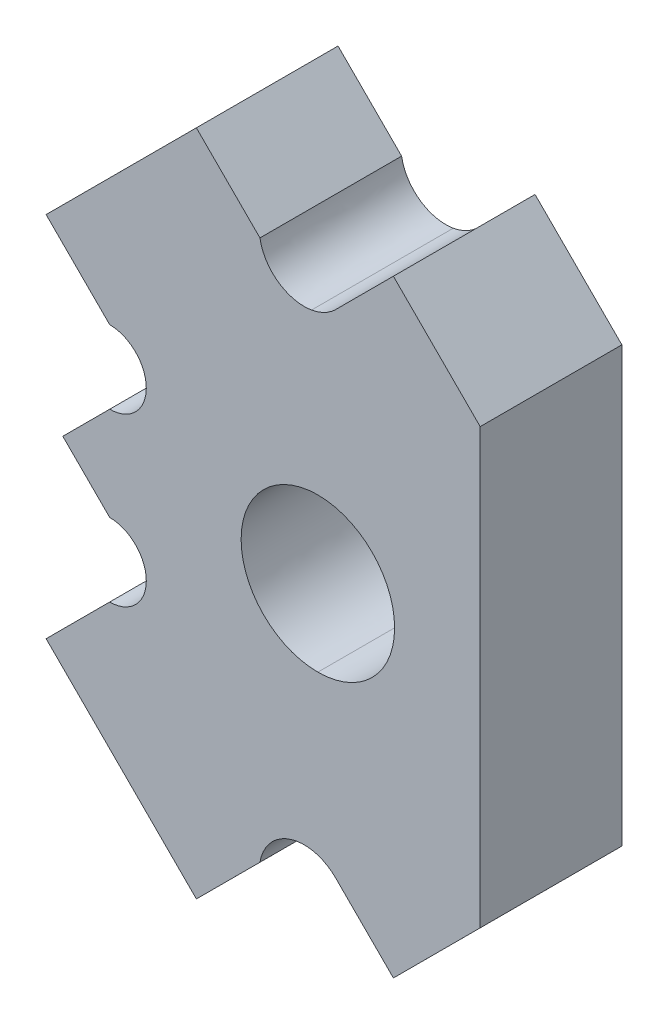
ISO-10303-21;
HEADER;
FILE_DESCRIPTION(('STEP AP214'),'2;1');
FILE_NAME('part.step','',(''),(''),'','','');
FILE_SCHEMA(('AUTOMOTIVE_DESIGN { 1 0 10303 214 1 1 1 1 }'));
ENDSEC;
DATA;
#1=APPLICATION_CONTEXT('core data for automotive mechanical design processes');
#2=APPLICATION_PROTOCOL_DEFINITION('international standard','automotive_design',2000,#1);
#3=PRODUCT_CONTEXT('',#1,'mechanical');
#4=PRODUCT('Part','Part','',(#3));
#5=PRODUCT_RELATED_PRODUCT_CATEGORY('part','',(#4));
#6=PRODUCT_DEFINITION_FORMATION('','',#4);
#7=PRODUCT_DEFINITION_CONTEXT('part definition',#1,'design');
#8=PRODUCT_DEFINITION('design','',#6,#7);
#9=PRODUCT_DEFINITION_SHAPE('','',#8);
#10=(LENGTH_UNIT() NAMED_UNIT(*) SI_UNIT(.MILLI.,.METRE.));
#11=(NAMED_UNIT(*) PLANE_ANGLE_UNIT() SI_UNIT($,.RADIAN.));
#12=(NAMED_UNIT(*) SI_UNIT($,.STERADIAN.) SOLID_ANGLE_UNIT());
#13=UNCERTAINTY_MEASURE_WITH_UNIT(LENGTH_MEASURE(1.E-05),#10,'distance_accuracy_value','');
#14=(GEOMETRIC_REPRESENTATION_CONTEXT(3) GLOBAL_UNCERTAINTY_ASSIGNED_CONTEXT((#13)) GLOBAL_UNIT_ASSIGNED_CONTEXT((#10,
#11,#12)) REPRESENTATION_CONTEXT('',''));
#15=CARTESIAN_POINT('',(0.,0.,0.));
#16=DIRECTION('',(0.,0.,1.));
#17=DIRECTION('',(1.,0.,0.));
#18=AXIS2_PLACEMENT_3D('',#15,#16,#17);
#19=CARTESIAN_POINT('',(1191.76413594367,-1191.62688077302,6.));
#20=DIRECTION('',(0.707147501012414,-0.707066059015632,0.));
#21=DIRECTION('',(0.707066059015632,0.707147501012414,0.));
#22=AXIS2_PLACEMENT_3D('',#19,#20,#21);
#23=PLANE('',#22);
#24=DIRECTION('',(-0.707066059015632,-0.707147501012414,0.));
#25=VECTOR('',#24,1.);
#26=CARTESIAN_POINT('',(1191.76413594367,-1191.62688077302,0.));
#27=LINE('',#26,#25);
#28=CARTESIAN_POINT('',(2460.98955317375,77.7447296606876,0.));
#29=VERTEX_POINT('',#28);
#30=CARTESIAN_POINT('',(2457.31280966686,74.0675626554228,0.));
#31=VERTEX_POINT('',#30);
#32=EDGE_CURVE('E426',#29,#31,#27,.T.);
#33=ORIENTED_EDGE('',*,*,#32,.F.);
#34=DIRECTION('',(0.,0.,-1.));
#35=VECTOR('',#34,1.);
#36=CARTESIAN_POINT('',(2460.98955317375,77.7447296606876,6.));
#37=LINE('',#36,#35);
#38=CARTESIAN_POINT('',(2460.98955317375,77.7447296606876,6.));
#39=VERTEX_POINT('',#38);
#40=EDGE_CURVE('E11',#39,#29,#37,.T.);
#41=ORIENTED_EDGE('',*,*,#40,.F.);
#42=DIRECTION('',(-0.707066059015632,-0.707147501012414,0.));
#43=VECTOR('',#42,1.);
#44=CARTESIAN_POINT('',(1191.76413594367,-1191.62688077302,6.));
#45=LINE('',#44,#43);
#46=CARTESIAN_POINT('',(2457.31280966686,74.0675626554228,6.));
#47=VERTEX_POINT('',#46);
#48=EDGE_CURVE('E445',#39,#47,#45,.T.);
#49=ORIENTED_EDGE('',*,*,#48,.T.);
#50=DIRECTION('',(0.,0.,-1.));
#51=VECTOR('',#50,1.);
#52=CARTESIAN_POINT('',(2457.31280966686,74.0675626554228,6.));
#53=LINE('',#52,#51);
#54=EDGE_CURVE('E56',#47,#31,#53,.T.);
#55=ORIENTED_EDGE('',*,*,#54,.T.);
#56=EDGE_LOOP('',(#33,#41,#49,#55));
#57=FACE_BOUND('',#56,.T.);
#58=ADVANCED_FACE('F36',(#57),#23,.T.);
#59=CARTESIAN_POINT('',(2460.99402219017,0.141724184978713,6.));
#60=DIRECTION('',(0.9999999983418,5.75881873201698E-05,0.));
#61=DIRECTION('',(-5.75881873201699E-05,0.9999999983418,0.));
#62=AXIS2_PLACEMENT_3D('',#59,#60,#61);
#63=PLANE('',#62);
#64=DIRECTION('',(5.75881873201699E-05,-0.9999999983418,0.));
#65=VECTOR('',#64,1.);
#66=CARTESIAN_POINT('',(2460.99402219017,0.141724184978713,0.));
#67=LINE('',#66,#65);
#68=CARTESIAN_POINT('',(2460.9884944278,96.129505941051,0.));
#69=VERTEX_POINT('',#68);
#70=EDGE_CURVE('E423',#69,#29,#67,.T.);
#71=ORIENTED_EDGE('',*,*,#70,.F.);
#72=DIRECTION('',(0.,0.,-1.));
#73=VECTOR('',#72,1.);
#74=CARTESIAN_POINT('',(2460.9884944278,96.129505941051,6.));
#75=LINE('',#74,#73);
#76=CARTESIAN_POINT('',(2460.9884944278,96.129505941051,6.));
#77=VERTEX_POINT('',#76);
#78=EDGE_CURVE('E47',#77,#69,#75,.T.);
#79=ORIENTED_EDGE('',*,*,#78,.F.);
#80=DIRECTION('',(5.75881873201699E-05,-0.9999999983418,0.));
#81=VECTOR('',#80,1.);
#82=CARTESIAN_POINT('',(2460.99402219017,0.141724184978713,6.));
#83=LINE('',#82,#81);
#84=EDGE_CURVE('E745',#77,#39,#83,.T.);
#85=ORIENTED_EDGE('',*,*,#84,.T.);
#86=ORIENTED_EDGE('',*,*,#40,.T.);
#87=EDGE_LOOP('',(#71,#79,#85,#86));
#88=FACE_BOUND('',#87,.T.);
#89=ADVANCED_FACE('F465',(#88),#63,.T.);
#90=CARTESIAN_POINT('',(1278.41727599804,1278.56452794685,6.));
#91=DIRECTION('',(0.707066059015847,0.707147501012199,0.));
#92=DIRECTION('',(-0.707147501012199,0.707066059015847,0.));
#93=AXIS2_PLACEMENT_3D('',#90,#91,#92);
#94=PLANE('',#93);
#95=DIRECTION('',(0.707147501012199,-0.707066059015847,0.));
#96=VECTOR('',#95,1.);
#97=CARTESIAN_POINT('',(1278.41727599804,1278.56452794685,0.));
#98=LINE('',#97,#96);
#99=CARTESIAN_POINT('',(2457.31132742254,99.8062494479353,0.));
#100=VERTEX_POINT('',#99);
#101=EDGE_CURVE('E420',#100,#69,#98,.T.);
#102=ORIENTED_EDGE('',*,*,#101,.F.);
#103=DIRECTION('',(0.,0.,-1.));
#104=VECTOR('',#103,1.);
#105=CARTESIAN_POINT('',(2457.31132742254,99.8062494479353,6.));
#106=LINE('',#105,#104);
#107=CARTESIAN_POINT('',(2457.31132742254,99.8062494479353,6.));
#108=VERTEX_POINT('',#107);
#109=EDGE_CURVE('E320',#108,#100,#106,.T.);
#110=ORIENTED_EDGE('',*,*,#109,.F.);
#111=DIRECTION('',(0.707147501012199,-0.707066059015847,0.));
#112=VECTOR('',#111,1.);
#113=CARTESIAN_POINT('',(1278.41727599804,1278.56452794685,6.));
#114=LINE('',#113,#112);
#115=EDGE_CURVE('E747',#108,#77,#114,.T.);
#116=ORIENTED_EDGE('',*,*,#115,.T.);
#117=ORIENTED_EDGE('',*,*,#78,.T.);
#118=EDGE_LOOP('',(#102,#110,#116,#117));
#119=FACE_BOUND('',#118,.T.);
#120=ADVANCED_FACE('F468',(#119),#94,.T.);
#121=CARTESIAN_POINT('',(1178.89405144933,-1178.75827849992,6.));
#122=DIRECTION('',(-0.707147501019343,0.707066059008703,0.));
#123=DIRECTION('',(-0.707066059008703,-0.707147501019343,0.));
#124=AXIS2_PLACEMENT_3D('',#121,#122,#123);
#125=PLANE('',#124);
#126=DIRECTION('',(0.707066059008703,0.707147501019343,0.));
#127=VECTOR('',#126,1.);
#128=CARTESIAN_POINT('',(1178.89405144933,-1178.75827849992,0.));
#129=LINE('',#128,#127);
#130=CARTESIAN_POINT('',(2454.86992334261,97.3645641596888,0.));
#131=VERTEX_POINT('',#130);
#132=EDGE_CURVE('E414',#131,#100,#129,.T.);
#133=ORIENTED_EDGE('',*,*,#132,.F.);
#134=DIRECTION('',(0.,0.,-1.));
#135=VECTOR('',#134,1.);
#136=CARTESIAN_POINT('',(2454.86992334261,97.3645641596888,6.));
#137=LINE('',#136,#135);
#138=CARTESIAN_POINT('',(2454.86992334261,97.3645641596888,6.));
#139=VERTEX_POINT('',#138);
#140=EDGE_CURVE('E318',#139,#131,#137,.T.);
#141=ORIENTED_EDGE('',*,*,#140,.F.);
#142=DIRECTION('',(0.707066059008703,0.707147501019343,0.));
#143=VECTOR('',#142,1.);
#144=CARTESIAN_POINT('',(1178.89405144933,-1178.75827849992,6.));
#145=LINE('',#144,#143);
#146=EDGE_CURVE('E492',#139,#108,#145,.T.);
#147=ORIENTED_EDGE('',*,*,#146,.T.);
#148=ORIENTED_EDGE('',*,*,#109,.T.);
#149=EDGE_LOOP('',(#133,#141,#147,#148));
#150=FACE_BOUND('',#149,.T.);
#151=ADVANCED_FACE('F472',(#150),#125,.T.);
#152=CARTESIAN_POINT('',(2453.84825756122,96.8362015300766,6.));
#153=CARTESIAN_POINT('',(2454.23530717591,96.9022840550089,6.));
#154=CARTESIAN_POINT('',(2454.59229360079,97.0869024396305,6.));
#155=CARTESIAN_POINT('',(2454.86992334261,97.3645641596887,6.));
#156=B_SPLINE_CURVE_WITH_KNOTS('',3,(#152,#153,#154,#155),.UNSPECIFIED.,.F.,.F.,(4,4),(18.,19.),.UNSPECIFIED.);
#157=DIRECTION('',(0.,0.,-1.));
#158=VECTOR('',#157,1.);
#159=SURFACE_OF_LINEAR_EXTRUSION('',#156,#158);
#160=CARTESIAN_POINT('',(2453.84825756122,96.8362015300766,0.));
#161=CARTESIAN_POINT('',(2454.23530717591,96.9022840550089,0.));
#162=CARTESIAN_POINT('',(2454.59229360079,97.0869024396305,0.));
#163=CARTESIAN_POINT('',(2454.86992334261,97.3645641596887,0.));
#164=B_SPLINE_CURVE_WITH_KNOTS('',3,(#160,#161,#162,#163),.UNSPECIFIED.,.F.,.F.,(4,4),(18.,19.),.UNSPECIFIED.);
#165=CARTESIAN_POINT('',(2453.84825756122,96.8362015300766,0.));
#166=VERTEX_POINT('',#165);
#167=EDGE_CURVE('E406',#166,#131,#164,.T.);
#168=ORIENTED_EDGE('',*,*,#167,.F.);
#169=DIRECTION('',(0.,0.,-1.));
#170=VECTOR('',#169,1.);
#171=CARTESIAN_POINT('',(2453.84825756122,96.8362015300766,6.));
#172=LINE('',#171,#170);
#173=CARTESIAN_POINT('',(2453.84825756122,96.8362015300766,6.));
#174=VERTEX_POINT('',#173);
#175=EDGE_CURVE('E316',#174,#166,#172,.T.);
#176=ORIENTED_EDGE('',*,*,#175,.F.);
#177=EDGE_CURVE('E485',#174,#139,#156,.T.);
#178=ORIENTED_EDGE('',*,*,#177,.T.);
#179=ORIENTED_EDGE('',*,*,#140,.T.);
#180=EDGE_LOOP('',(#168,#176,#178,#179));
#181=FACE_BOUND('',#180,.T.);
#182=ADVANCED_FACE('F476',(#181),#159,.T.);
#183=CARTESIAN_POINT('',(2451.66018986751,98.3860755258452,6.));
#184=CARTESIAN_POINT('',(2451.83642219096,97.353871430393,6.));
#185=CARTESIAN_POINT('',(2452.81605346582,96.6599692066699,6.));
#186=CARTESIAN_POINT('',(2453.84825756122,96.8362015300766,6.));
#187=B_SPLINE_CURVE_WITH_KNOTS('',3,(#183,#184,#185,#186),.UNSPECIFIED.,.F.,.F.,(4,4),(17.,18.),.UNSPECIFIED.);
#188=DIRECTION('',(0.,0.,-1.));
#189=VECTOR('',#188,1.);
#190=SURFACE_OF_LINEAR_EXTRUSION('',#187,#189);
#191=CARTESIAN_POINT('',(2451.66018986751,98.3860755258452,0.));
#192=CARTESIAN_POINT('',(2451.83642219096,97.353871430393,0.));
#193=CARTESIAN_POINT('',(2452.81605346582,96.6599692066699,0.));
#194=CARTESIAN_POINT('',(2453.84825756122,96.8362015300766,0.));
#195=B_SPLINE_CURVE_WITH_KNOTS('',3,(#191,#192,#193,#194),.UNSPECIFIED.,.F.,.F.,(4,4),(17.,18.),.UNSPECIFIED.);
#196=CARTESIAN_POINT('',(2451.66018986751,98.386075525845,0.));
#197=VERTEX_POINT('',#196);
#198=EDGE_CURVE('E401',#197,#166,#195,.T.);
#199=ORIENTED_EDGE('',*,*,#198,.F.);
#200=DIRECTION('',(0.,0.,-1.));
#201=VECTOR('',#200,1.);
#202=CARTESIAN_POINT('',(2451.66018986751,98.386075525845,6.));
#203=LINE('',#202,#201);
#204=CARTESIAN_POINT('',(2451.66018986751,98.386075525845,6.));
#205=VERTEX_POINT('',#204);
#206=EDGE_CURVE('E314',#205,#197,#203,.T.);
#207=ORIENTED_EDGE('',*,*,#206,.F.);
#208=EDGE_CURVE('E491',#205,#174,#187,.T.);
#209=ORIENTED_EDGE('',*,*,#208,.T.);
#210=ORIENTED_EDGE('',*,*,#175,.T.);
#211=EDGE_LOOP('',(#199,#207,#209,#210));
#212=FACE_BOUND('',#211,.T.);
#213=ADVANCED_FACE('F481',(#212),#190,.T.);
#214=CARTESIAN_POINT('',(1274.88194570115,1275.02879044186,6.));
#215=DIRECTION('',(0.707066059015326,0.70714750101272,0.));
#216=DIRECTION('',(-0.70714750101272,0.707066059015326,0.));
#217=AXIS2_PLACEMENT_3D('',#214,#215,#216);
#218=PLANE('',#217);
#219=DIRECTION('',(0.70714750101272,-0.707066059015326,0.));
#220=VECTOR('',#219,1.);
#221=CARTESIAN_POINT('',(1274.88194570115,1275.02879044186,0.));
#222=LINE('',#221,#220);
#223=CARTESIAN_POINT('',(2448.96739412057,101.078561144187,0.));
#224=VERTEX_POINT('',#223);
#225=EDGE_CURVE('E398',#224,#197,#222,.T.);
#226=ORIENTED_EDGE('',*,*,#225,.F.);
#227=DIRECTION('',(0.,0.,-1.));
#228=VECTOR('',#227,1.);
#229=CARTESIAN_POINT('',(2448.96739412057,101.078561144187,6.));
#230=LINE('',#229,#228);
#231=CARTESIAN_POINT('',(2448.96739412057,101.078561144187,6.));
#232=VERTEX_POINT('',#231);
#233=EDGE_CURVE('E312',#232,#224,#230,.T.);
#234=ORIENTED_EDGE('',*,*,#233,.F.);
#235=DIRECTION('',(0.70714750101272,-0.707066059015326,0.));
#236=VECTOR('',#235,1.);
#237=CARTESIAN_POINT('',(1274.88194570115,1275.02879044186,6.));
#238=LINE('',#237,#236);
#239=EDGE_CURVE('E502',#232,#205,#238,.T.);
#240=ORIENTED_EDGE('',*,*,#239,.T.);
#241=ORIENTED_EDGE('',*,*,#206,.T.);
#242=EDGE_LOOP('',(#226,#234,#240,#241));
#243=FACE_BOUND('',#242,.T.);
#244=ADVANCED_FACE('F542',(#243),#218,.T.);
#245=CARTESIAN_POINT('',(1174.08544841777,-1173.95022929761,6.));
#246=DIRECTION('',(-0.707147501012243,0.707066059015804,0.));
#247=DIRECTION('',(-0.707066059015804,-0.707147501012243,0.));
#248=AXIS2_PLACEMENT_3D('',#245,#246,#247);
#249=PLANE('',#248);
#250=DIRECTION('',(0.707066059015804,0.707147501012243,0.));
#251=VECTOR('',#250,1.);
#252=CARTESIAN_POINT('',(1174.08544841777,-1173.95022929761,0.));
#253=LINE('',#252,#251);
#254=CARTESIAN_POINT('',(2442.60379958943,94.7142336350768,0.));
#255=VERTEX_POINT('',#254);
#256=EDGE_CURVE('E395',#255,#224,#253,.T.);
#257=ORIENTED_EDGE('',*,*,#256,.F.);
#258=DIRECTION('',(0.,0.,-1.));
#259=VECTOR('',#258,1.);
#260=CARTESIAN_POINT('',(2442.60379958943,94.7142336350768,6.));
#261=LINE('',#260,#259);
#262=CARTESIAN_POINT('',(2442.60379958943,94.7142336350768,6.));
#263=VERTEX_POINT('',#262);
#264=EDGE_CURVE('E310',#263,#255,#261,.T.);
#265=ORIENTED_EDGE('',*,*,#264,.F.);
#266=DIRECTION('',(0.707066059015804,0.707147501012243,0.));
#267=VECTOR('',#266,1.);
#268=CARTESIAN_POINT('',(1174.08544841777,-1173.95022929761,6.));
#269=LINE('',#268,#267);
#270=EDGE_CURVE('E508',#263,#232,#269,.T.);
#271=ORIENTED_EDGE('',*,*,#270,.T.);
#272=ORIENTED_EDGE('',*,*,#233,.T.);
#273=EDGE_LOOP('',(#257,#265,#271,#272));
#274=FACE_BOUND('',#273,.T.);
#275=ADVANCED_FACE('F539',(#274),#249,.T.);
#276=CARTESIAN_POINT('',(1268.518351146,1268.66446293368,6.));
#277=DIRECTION('',(-0.707066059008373,-0.707147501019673,0.));
#278=DIRECTION('',(0.707147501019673,-0.707066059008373,0.));
#279=AXIS2_PLACEMENT_3D('',#276,#277,#278);
#280=PLANE('',#279);
#281=DIRECTION('',(-0.707147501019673,0.707066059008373,0.));
#282=VECTOR('',#281,1.);
#283=CARTESIAN_POINT('',(1268.518351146,1268.66446293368,0.));
#284=LINE('',#283,#282);
#285=CARTESIAN_POINT('',(2445.29659533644,92.0217480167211,0.));
#286=VERTEX_POINT('',#285);
#287=EDGE_CURVE('E389',#286,#255,#284,.T.);
#288=ORIENTED_EDGE('',*,*,#287,.F.);
#289=DIRECTION('',(0.,0.,-1.));
#290=VECTOR('',#289,1.);
#291=CARTESIAN_POINT('',(2445.29659533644,92.0217480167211,6.));
#292=LINE('',#291,#290);
#293=CARTESIAN_POINT('',(2445.29659533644,92.0217480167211,6.));
#294=VERTEX_POINT('',#293);
#295=EDGE_CURVE('E308',#294,#286,#292,.T.);
#296=ORIENTED_EDGE('',*,*,#295,.F.);
#297=DIRECTION('',(-0.707147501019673,0.707066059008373,0.));
#298=VECTOR('',#297,1.);
#299=CARTESIAN_POINT('',(1268.518351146,1268.66446293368,6.));
#300=LINE('',#299,#298);
#301=EDGE_CURVE('E511',#294,#263,#300,.T.);
#302=ORIENTED_EDGE('',*,*,#301,.T.);
#303=ORIENTED_EDGE('',*,*,#264,.T.);
#304=EDGE_LOOP('',(#288,#296,#302,#303));
#305=FACE_BOUND('',#304,.T.);
#306=ADVANCED_FACE('F534',(#305),#280,.T.);
#307=CARTESIAN_POINT('',(2446.84668459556,90.4718372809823,6.));
#308=CARTESIAN_POINT('',(2446.84663529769,91.3278786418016,6.));
#309=CARTESIAN_POINT('',(2446.15263669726,92.0217973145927,6.));
#310=CARTESIAN_POINT('',(2445.29659533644,92.0217480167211,6.));
#311=B_SPLINE_CURVE_WITH_KNOTS('',3,(#307,#308,#309,#310),.UNSPECIFIED.,.F.,.F.,(4,4),(13.,14.),.UNSPECIFIED.);
#312=DIRECTION('',(0.,0.,-1.));
#313=VECTOR('',#312,1.);
#314=SURFACE_OF_LINEAR_EXTRUSION('',#311,#313);
#315=CARTESIAN_POINT('',(2446.84668459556,90.4718372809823,0.));
#316=CARTESIAN_POINT('',(2446.84663529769,91.3278786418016,0.));
#317=CARTESIAN_POINT('',(2446.15263669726,92.0217973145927,0.));
#318=CARTESIAN_POINT('',(2445.29659533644,92.0217480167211,0.));
#319=B_SPLINE_CURVE_WITH_KNOTS('',3,(#315,#316,#317,#318),.UNSPECIFIED.,.F.,.F.,(4,4),(13.,14.),.UNSPECIFIED.);
#320=CARTESIAN_POINT('',(2446.84668459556,90.4718372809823,0.));
#321=VERTEX_POINT('',#320);
#322=EDGE_CURVE('E381',#321,#286,#319,.T.);
#323=ORIENTED_EDGE('',*,*,#322,.F.);
#324=DIRECTION('',(0.,0.,-1.));
#325=VECTOR('',#324,1.);
#326=CARTESIAN_POINT('',(2446.84668459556,90.4718372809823,6.));
#327=LINE('',#326,#325);
#328=CARTESIAN_POINT('',(2446.84668459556,90.4718372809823,6.));
#329=VERTEX_POINT('',#328);
#330=EDGE_CURVE('E306',#329,#321,#327,.T.);
#331=ORIENTED_EDGE('',*,*,#330,.F.);
#332=EDGE_CURVE('E514',#329,#294,#311,.T.);
#333=ORIENTED_EDGE('',*,*,#332,.T.);
#334=ORIENTED_EDGE('',*,*,#295,.T.);
#335=EDGE_LOOP('',(#323,#331,#333,#334));
#336=FACE_BOUND('',#335,.T.);
#337=ADVANCED_FACE('F529',(#336),#314,.T.);
#338=CARTESIAN_POINT('',(2445.29677385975,88.9217480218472,6.));
#339=CARTESIAN_POINT('',(2446.15281522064,88.9217973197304,6.));
#340=CARTESIAN_POINT('',(2446.84673389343,89.6157959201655,6.));
#341=CARTESIAN_POINT('',(2446.84668459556,90.4718372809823,6.));
#342=B_SPLINE_CURVE_WITH_KNOTS('',3,(#338,#339,#340,#341),.UNSPECIFIED.,.F.,.F.,(4,4),(12.,13.),.UNSPECIFIED.);
#343=DIRECTION('',(0.,0.,-1.));
#344=VECTOR('',#343,1.);
#345=SURFACE_OF_LINEAR_EXTRUSION('',#342,#344);
#346=CARTESIAN_POINT('',(2445.29677385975,88.9217480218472,0.));
#347=CARTESIAN_POINT('',(2446.15281522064,88.9217973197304,0.));
#348=CARTESIAN_POINT('',(2446.84673389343,89.6157959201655,0.));
#349=CARTESIAN_POINT('',(2446.84668459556,90.4718372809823,0.));
#350=B_SPLINE_CURVE_WITH_KNOTS('',3,(#346,#347,#348,#349),.UNSPECIFIED.,.F.,.F.,(4,4),(12.,13.),.UNSPECIFIED.);
#351=CARTESIAN_POINT('',(2445.29677385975,88.9217480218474,0.));
#352=VERTEX_POINT('',#351);
#353=EDGE_CURVE('E376',#352,#321,#350,.T.);
#354=ORIENTED_EDGE('',*,*,#353,.F.);
#355=DIRECTION('',(0.,0.,-1.));
#356=VECTOR('',#355,1.);
#357=CARTESIAN_POINT('',(2445.29677385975,88.9217480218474,6.));
#358=LINE('',#357,#356);
#359=CARTESIAN_POINT('',(2445.29677385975,88.9217480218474,6.));
#360=VERTEX_POINT('',#359);
#361=EDGE_CURVE('E304',#360,#352,#358,.T.);
#362=ORIENTED_EDGE('',*,*,#361,.F.);
#363=EDGE_CURVE('E520',#360,#329,#342,.T.);
#364=ORIENTED_EDGE('',*,*,#363,.T.);
#365=ORIENTED_EDGE('',*,*,#330,.T.);
#366=EDGE_LOOP('',(#354,#362,#364,#365));
#367=FACE_BOUND('',#366,.T.);
#368=ADVANCED_FACE('F533',(#367),#345,.T.);
#369=CARTESIAN_POINT('',(1178.32833342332,-1178.19262565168,6.));
#370=DIRECTION('',(-0.707147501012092,0.707066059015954,0.));
#371=DIRECTION('',(-0.707066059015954,-0.707147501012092,0.));
#372=AXIS2_PLACEMENT_3D('',#369,#370,#371);
#373=PLANE('',#372);
#374=DIRECTION('',(0.707066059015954,0.707147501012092,0.));
#375=VECTOR('',#374,1.);
#376=CARTESIAN_POINT('',(1178.32833342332,-1178.19262565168,0.));
#377=LINE('',#376,#375);
#378=CARTESIAN_POINT('',(2443.31135430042,86.9360997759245,0.));
#379=VERTEX_POINT('',#378);
#380=EDGE_CURVE('E373',#379,#352,#377,.T.);
#381=ORIENTED_EDGE('',*,*,#380,.F.);
#382=DIRECTION('',(0.,0.,-1.));
#383=VECTOR('',#382,1.);
#384=CARTESIAN_POINT('',(2443.31135430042,86.9360997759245,6.));
#385=LINE('',#384,#383);
#386=CARTESIAN_POINT('',(2443.31135430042,86.9360997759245,6.));
#387=VERTEX_POINT('',#386);
#388=EDGE_CURVE('E302',#387,#379,#385,.T.);
#389=ORIENTED_EDGE('',*,*,#388,.F.);
#390=DIRECTION('',(0.707066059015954,0.707147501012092,0.));
#391=VECTOR('',#390,1.);
#392=CARTESIAN_POINT('',(1178.32833342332,-1178.19262565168,6.));
#393=LINE('',#392,#391);
#394=EDGE_CURVE('E566',#387,#360,#393,.T.);
#395=ORIENTED_EDGE('',*,*,#394,.T.);
#396=ORIENTED_EDGE('',*,*,#361,.T.);
#397=EDGE_LOOP('',(#381,#389,#395,#396));
#398=FACE_BOUND('',#397,.T.);
#399=ADVANCED_FACE('F668',(#398),#373,.T.);
#400=CARTESIAN_POINT('',(1264.98302084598,1265.12872542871,6.));
#401=DIRECTION('',(-0.707066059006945,-0.7071475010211,0.));
#402=DIRECTION('',(0.7071475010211,-0.707066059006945,0.));
#403=AXIS2_PLACEMENT_3D('',#400,#401,#402);
#404=PLANE('',#403);
#405=DIRECTION('',(-0.7071475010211,0.707066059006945,0.));
#406=VECTOR('',#405,1.);
#407=CARTESIAN_POINT('',(1264.98302084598,1265.12872542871,0.));
#408=LINE('',#407,#406);
#409=CARTESIAN_POINT('',(2445.29700254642,84.9506802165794,0.));
#410=VERTEX_POINT('',#409);
#411=EDGE_CURVE('E367',#410,#379,#408,.T.);
#412=ORIENTED_EDGE('',*,*,#411,.F.);
#413=DIRECTION('',(0.,0.,-1.));
#414=VECTOR('',#413,1.);
#415=CARTESIAN_POINT('',(2445.29700254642,84.9506802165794,6.));
#416=LINE('',#415,#414);
#417=CARTESIAN_POINT('',(2445.29700254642,84.9506802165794,6.));
#418=VERTEX_POINT('',#417);
#419=EDGE_CURVE('E300',#418,#410,#416,.T.);
#420=ORIENTED_EDGE('',*,*,#419,.F.);
#421=DIRECTION('',(-0.7071475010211,0.707066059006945,0.));
#422=VECTOR('',#421,1.);
#423=CARTESIAN_POINT('',(1264.98302084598,1265.12872542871,6.));
#424=LINE('',#423,#422);
#425=EDGE_CURVE('E567',#418,#387,#424,.T.);
#426=ORIENTED_EDGE('',*,*,#425,.T.);
#427=ORIENTED_EDGE('',*,*,#388,.T.);
#428=EDGE_LOOP('',(#412,#420,#426,#427));
#429=FACE_BOUND('',#428,.T.);
#430=ADVANCED_FACE('F660',(#429),#404,.T.);
#431=CARTESIAN_POINT('',(2446.84709180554,83.4007694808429,6.));
#432=CARTESIAN_POINT('',(2446.84704250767,84.2568108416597,6.));
#433=CARTESIAN_POINT('',(2446.15304390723,84.9507295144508,6.));
#434=CARTESIAN_POINT('',(2445.29700254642,84.9506802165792,6.));
#435=B_SPLINE_CURVE_WITH_KNOTS('',3,(#431,#432,#433,#434),.UNSPECIFIED.,.F.,.F.,(4,4),(9.,10.),.UNSPECIFIED.);
#436=DIRECTION('',(0.,0.,-1.));
#437=VECTOR('',#436,1.);
#438=SURFACE_OF_LINEAR_EXTRUSION('',#435,#437);
#439=CARTESIAN_POINT('',(2446.84709180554,83.4007694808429,0.));
#440=CARTESIAN_POINT('',(2446.84704250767,84.2568108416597,0.));
#441=CARTESIAN_POINT('',(2446.15304390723,84.9507295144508,0.));
#442=CARTESIAN_POINT('',(2445.29700254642,84.9506802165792,0.));
#443=B_SPLINE_CURVE_WITH_KNOTS('',3,(#439,#440,#441,#442),.UNSPECIFIED.,.F.,.F.,(4,4),(9.,10.),.UNSPECIFIED.);
#444=CARTESIAN_POINT('',(2446.84709180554,83.4007694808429,0.));
#445=VERTEX_POINT('',#444);
#446=EDGE_CURVE('E359',#445,#410,#443,.T.);
#447=ORIENTED_EDGE('',*,*,#446,.F.);
#448=DIRECTION('',(0.,0.,-1.));
#449=VECTOR('',#448,1.);
#450=CARTESIAN_POINT('',(2446.84709180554,83.4007694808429,6.));
#451=LINE('',#450,#449);
#452=CARTESIAN_POINT('',(2446.84709180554,83.4007694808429,6.));
#453=VERTEX_POINT('',#452);
#454=EDGE_CURVE('E298',#453,#445,#451,.T.);
#455=ORIENTED_EDGE('',*,*,#454,.F.);
#456=EDGE_CURVE('E273',#453,#418,#435,.T.);
#457=ORIENTED_EDGE('',*,*,#456,.T.);
#458=ORIENTED_EDGE('',*,*,#419,.T.);
#459=EDGE_LOOP('',(#447,#455,#457,#458));
#460=FACE_BOUND('',#459,.T.);
#461=ADVANCED_FACE('F262',(#460),#438,.T.);
#462=CARTESIAN_POINT('',(2445.29718106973,81.850680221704,6.));
#463=CARTESIAN_POINT('',(2446.15322243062,81.850729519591,6.));
#464=CARTESIAN_POINT('',(2446.84714110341,82.5447281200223,6.));
#465=CARTESIAN_POINT('',(2446.84709180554,83.4007694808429,6.));
#466=B_SPLINE_CURVE_WITH_KNOTS('',3,(#462,#463,#464,#465),.UNSPECIFIED.,.F.,.F.,(4,4),(8.,9.),.UNSPECIFIED.);
#467=DIRECTION('',(0.,0.,-1.));
#468=VECTOR('',#467,1.);
#469=SURFACE_OF_LINEAR_EXTRUSION('',#466,#468);
#470=CARTESIAN_POINT('',(2445.29718106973,81.850680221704,0.));
#471=CARTESIAN_POINT('',(2446.15322243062,81.850729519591,0.));
#472=CARTESIAN_POINT('',(2446.84714110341,82.5447281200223,0.));
#473=CARTESIAN_POINT('',(2446.84709180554,83.4007694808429,0.));
#474=B_SPLINE_CURVE_WITH_KNOTS('',3,(#470,#471,#472,#473),.UNSPECIFIED.,.F.,.F.,(4,4),(8.,9.),.UNSPECIFIED.);
#475=CARTESIAN_POINT('',(2445.29718106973,81.8506802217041,0.));
#476=VERTEX_POINT('',#475);
#477=EDGE_CURVE('E354',#476,#445,#474,.T.);
#478=ORIENTED_EDGE('',*,*,#477,.F.);
#479=DIRECTION('',(0.,0.,-1.));
#480=VECTOR('',#479,1.);
#481=CARTESIAN_POINT('',(2445.29718106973,81.8506802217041,6.));
#482=LINE('',#481,#480);
#483=CARTESIAN_POINT('',(2445.29718106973,81.8506802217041,6.));
#484=VERTEX_POINT('',#483);
#485=EDGE_CURVE('E296',#484,#476,#482,.T.);
#486=ORIENTED_EDGE('',*,*,#485,.F.);
#487=EDGE_CURVE('E266',#484,#453,#466,.T.);
#488=ORIENTED_EDGE('',*,*,#487,.T.);
#489=ORIENTED_EDGE('',*,*,#454,.T.);
#490=EDGE_LOOP('',(#478,#486,#488,#489));
#491=FACE_BOUND('',#490,.T.);
#492=ADVANCED_FACE('F257',(#491),#469,.T.);
#493=CARTESIAN_POINT('',(1181.86407092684,-1181.72795594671,6.));
#494=DIRECTION('',(-0.707147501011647,0.7070660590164,0.));
#495=DIRECTION('',(-0.7070660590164,-0.707147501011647,0.));
#496=AXIS2_PLACEMENT_3D('',#493,#494,#495);
#497=PLANE('',#496);
#498=DIRECTION('',(0.7070660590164,0.707147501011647,0.));
#499=VECTOR('',#498,1.);
#500=CARTESIAN_POINT('',(1181.86407092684,-1181.72795594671,0.));
#501=LINE('',#500,#499);
#502=CARTESIAN_POINT('',(2442.60469545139,79.1578844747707,0.));
#503=VERTEX_POINT('',#502);
#504=EDGE_CURVE('E351',#503,#476,#501,.T.);
#505=ORIENTED_EDGE('',*,*,#504,.F.);
#506=DIRECTION('',(0.,0.,-1.));
#507=VECTOR('',#506,1.);
#508=CARTESIAN_POINT('',(2442.60469545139,79.1578844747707,6.));
#509=LINE('',#508,#507);
#510=CARTESIAN_POINT('',(2442.60469545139,79.1578844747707,6.));
#511=VERTEX_POINT('',#510);
#512=EDGE_CURVE('E291',#511,#503,#509,.T.);
#513=ORIENTED_EDGE('',*,*,#512,.F.);
#514=DIRECTION('',(0.7070660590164,0.707147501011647,0.));
#515=VECTOR('',#514,1.);
#516=CARTESIAN_POINT('',(1181.86407092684,-1181.72795594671,6.));
#517=LINE('',#516,#515);
#518=EDGE_CURVE('E272',#511,#484,#517,.T.);
#519=ORIENTED_EDGE('',*,*,#518,.T.);
#520=ORIENTED_EDGE('',*,*,#485,.T.);
#521=EDGE_LOOP('',(#505,#513,#519,#520));
#522=FACE_BOUND('',#521,.T.);
#523=ADVANCED_FACE('F253',(#522),#497,.T.);
#524=CARTESIAN_POINT('',(1260.74062452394,1260.8858404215,6.));
#525=DIRECTION('',(-0.707066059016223,-0.707147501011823,0.));
#526=DIRECTION('',(0.707147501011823,-0.707066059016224,0.));
#527=AXIS2_PLACEMENT_3D('',#524,#525,#526);
#528=PLANE('',#527);
#529=DIRECTION('',(-0.707147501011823,0.707066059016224,0.));
#530=VECTOR('',#529,1.);
#531=CARTESIAN_POINT('',(1260.74062452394,1260.8858404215,0.));
#532=LINE('',#531,#530);
#533=CARTESIAN_POINT('',(2448.96902296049,72.7942899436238,0.));
#534=VERTEX_POINT('',#533);
#535=EDGE_CURVE('E348',#534,#503,#532,.T.);
#536=ORIENTED_EDGE('',*,*,#535,.F.);
#537=DIRECTION('',(0.,0.,-1.));
#538=VECTOR('',#537,1.);
#539=CARTESIAN_POINT('',(2448.96902296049,72.7942899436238,6.));
#540=LINE('',#539,#538);
#541=CARTESIAN_POINT('',(2448.96902296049,72.7942899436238,6.));
#542=VERTEX_POINT('',#541);
#543=EDGE_CURVE('E286',#542,#534,#540,.T.);
#544=ORIENTED_EDGE('',*,*,#543,.F.);
#545=DIRECTION('',(-0.707147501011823,0.707066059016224,0.));
#546=VECTOR('',#545,1.);
#547=CARTESIAN_POINT('',(1260.74062452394,1260.8858404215,6.));
#548=LINE('',#547,#546);
#549=EDGE_CURVE('E283',#542,#511,#548,.T.);
#550=ORIENTED_EDGE('',*,*,#549,.T.);
#551=ORIENTED_EDGE('',*,*,#512,.T.);
#552=EDGE_LOOP('',(#536,#544,#550,#551));
#553=FACE_BOUND('',#552,.T.);
#554=ADVANCED_FACE('F249',(#553),#528,.T.);
#555=CARTESIAN_POINT('',(1188.22839844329,-1188.09155047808,6.));
#556=DIRECTION('',(0.707147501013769,-0.707066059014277,0.));
#557=DIRECTION('',(0.707066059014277,0.707147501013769,0.));
#558=AXIS2_PLACEMENT_3D('',#555,#556,#557);
#559=PLANE('',#558);
#560=DIRECTION('',(-0.707066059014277,-0.707147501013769,0.));
#561=VECTOR('',#560,1.);
#562=CARTESIAN_POINT('',(1188.22839844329,-1188.09155047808,0.));
#563=LINE('',#562,#561);
#564=CARTESIAN_POINT('',(2451.66150857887,75.4870856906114,0.));
#565=VERTEX_POINT('',#564);
#566=EDGE_CURVE('E289',#565,#534,#563,.T.);
#567=ORIENTED_EDGE('',*,*,#566,.F.);
#568=DIRECTION('',(0.,0.,-1.));
#569=VECTOR('',#568,1.);
#570=CARTESIAN_POINT('',(2451.66150857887,75.4870856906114,6.));
#571=LINE('',#570,#569);
#572=CARTESIAN_POINT('',(2451.66150857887,75.4870856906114,6.));
#573=VERTEX_POINT('',#572);
#574=EDGE_CURVE('E209',#573,#565,#571,.T.);
#575=ORIENTED_EDGE('',*,*,#574,.F.);
#576=DIRECTION('',(-0.707066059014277,-0.707147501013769,0.));
#577=VECTOR('',#576,1.);
#578=CARTESIAN_POINT('',(1188.22839844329,-1188.09155047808,6.));
#579=LINE('',#578,#577);
#580=EDGE_CURVE('E220',#573,#542,#579,.T.);
#581=ORIENTED_EDGE('',*,*,#580,.T.);
#582=ORIENTED_EDGE('',*,*,#543,.T.);
#583=EDGE_LOOP('',(#567,#575,#581,#582));
#584=FACE_BOUND('',#583,.T.);
#585=ADVANCED_FACE('F246',(#584),#559,.T.);
#586=CARTESIAN_POINT('',(2452.18975353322,76.5088123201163,6.));
#587=CARTESIAN_POINT('',(2451.91212379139,76.2311506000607,6.));
#588=CARTESIAN_POINT('',(2451.7275465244,75.8741429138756,6.));
#589=CARTESIAN_POINT('',(2451.66150857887,75.4870856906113,6.));
#590=B_SPLINE_CURVE_WITH_KNOTS('',3,(#586,#587,#588,#589),.UNSPECIFIED.,.F.,.F.,(4,4),(4.,5.),.UNSPECIFIED.);
#591=DIRECTION('',(0.,0.,-1.));
#592=VECTOR('',#591,1.);
#593=SURFACE_OF_LINEAR_EXTRUSION('',#590,#592);
#594=CARTESIAN_POINT('',(2452.18975353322,76.5088123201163,0.));
#595=CARTESIAN_POINT('',(2451.91212379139,76.2311506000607,0.));
#596=CARTESIAN_POINT('',(2451.7275465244,75.8741429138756,0.));
#597=CARTESIAN_POINT('',(2451.66150857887,75.4870856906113,0.));
#598=B_SPLINE_CURVE_WITH_KNOTS('',3,(#594,#595,#596,#597),.UNSPECIFIED.,.F.,.F.,(4,4),(4.,5.),.UNSPECIFIED.);
#599=CARTESIAN_POINT('',(2452.18975353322,76.5088123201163,0.));
#600=VERTEX_POINT('',#599);
#601=EDGE_CURVE('E205',#600,#565,#598,.T.);
#602=ORIENTED_EDGE('',*,*,#601,.F.);
#603=DIRECTION('',(0.,0.,-1.));
#604=VECTOR('',#603,1.);
#605=CARTESIAN_POINT('',(2452.18975353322,76.5088123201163,6.));
#606=LINE('',#605,#604);
#607=CARTESIAN_POINT('',(2452.18975353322,76.5088123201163,6.));
#608=VERTEX_POINT('',#607);
#609=EDGE_CURVE('E200',#608,#600,#606,.T.);
#610=ORIENTED_EDGE('',*,*,#609,.F.);
#611=EDGE_CURVE('E203',#608,#573,#590,.T.);
#612=ORIENTED_EDGE('',*,*,#611,.T.);
#613=ORIENTED_EDGE('',*,*,#574,.T.);
#614=EDGE_LOOP('',(#602,#610,#612,#613));
#615=FACE_BOUND('',#614,.T.);
#616=ADVANCED_FACE('F202',(#615),#593,.T.);
#617=CARTESIAN_POINT('',(2454.87112437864,76.5089667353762,6.));
#618=CARTESIAN_POINT('',(2454.13064162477,77.2493642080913,6.));
#619=CARTESIAN_POINT('',(2452.93015100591,77.2492950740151,6.));
#620=CARTESIAN_POINT('',(2452.18975353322,76.5088123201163,6.));
#621=B_SPLINE_CURVE_WITH_KNOTS('',3,(#617,#618,#619,#620),.UNSPECIFIED.,.F.,.F.,(4,4),(3.,4.),.UNSPECIFIED.);
#622=DIRECTION('',(0.,0.,-1.));
#623=VECTOR('',#622,1.);
#624=SURFACE_OF_LINEAR_EXTRUSION('',#621,#623);
#625=CARTESIAN_POINT('',(2454.87112437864,76.5089667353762,0.));
#626=CARTESIAN_POINT('',(2454.13064162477,77.2493642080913,0.));
#627=CARTESIAN_POINT('',(2452.93015100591,77.2492950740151,0.));
#628=CARTESIAN_POINT('',(2452.18975353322,76.5088123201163,0.));
#629=B_SPLINE_CURVE_WITH_KNOTS('',3,(#625,#626,#627,#628),.UNSPECIFIED.,.F.,.F.,(4,4),(3.,4.),.UNSPECIFIED.);
#630=CARTESIAN_POINT('',(2454.87112437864,76.5089667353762,0.));
#631=VERTEX_POINT('',#630);
#632=EDGE_CURVE('E334',#631,#600,#629,.T.);
#633=ORIENTED_EDGE('',*,*,#632,.F.);
#634=DIRECTION('',(0.,0.,-1.));
#635=VECTOR('',#634,1.);
#636=CARTESIAN_POINT('',(2454.87112437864,76.5089667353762,6.));
#637=LINE('',#636,#635);
#638=CARTESIAN_POINT('',(2454.87112437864,76.5089667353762,6.));
#639=VERTEX_POINT('',#638);
#640=EDGE_CURVE('E126',#639,#631,#637,.T.);
#641=ORIENTED_EDGE('',*,*,#640,.F.);
#642=EDGE_CURVE('E217',#639,#608,#621,.T.);
#643=ORIENTED_EDGE('',*,*,#642,.T.);
#644=ORIENTED_EDGE('',*,*,#609,.T.);
#645=EDGE_LOOP('',(#633,#641,#643,#644));
#646=FACE_BOUND('',#645,.T.);
#647=ADVANCED_FACE('F222',(#646),#624,.T.);
#648=CARTESIAN_POINT('',(2454.1130894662,83.6864255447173,6.));
#649=CARTESIAN_POINT('',(2452.3181640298,83.6864255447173,6.));
#650=CARTESIAN_POINT('',(2450.86308946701,85.1415001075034,6.));
#651=CARTESIAN_POINT('',(2450.86308946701,88.7313509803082,6.));
#652=CARTESIAN_POINT('',(2452.3181640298,90.1864255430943,6.));
#653=CARTESIAN_POINT('',(2454.1130894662,90.1864255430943,6.));
#654=B_SPLINE_CURVE_WITH_KNOTS('',3,(#648,#649,#650,#651,#652,#653),.UNSPECIFIED.,.F.,.F.,(4,2,
4),(0.,1.,2.),.UNSPECIFIED.);
#655=DIRECTION('',(0.,0.,-1.));
#656=VECTOR('',#655,1.);
#657=SURFACE_OF_LINEAR_EXTRUSION('',#654,#656);
#658=CARTESIAN_POINT('',(2454.1130894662,83.6864255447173,0.));
#659=CARTESIAN_POINT('',(2452.3181640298,83.6864255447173,0.));
#660=CARTESIAN_POINT('',(2450.86308946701,85.1415001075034,0.));
#661=CARTESIAN_POINT('',(2450.86308946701,88.7313509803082,0.));
#662=CARTESIAN_POINT('',(2452.3181640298,90.1864255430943,0.));
#663=CARTESIAN_POINT('',(2454.1130894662,90.1864255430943,0.));
#664=B_SPLINE_CURVE_WITH_KNOTS('',3,(#658,#659,#660,#661,#662,#663),.UNSPECIFIED.,.F.,.F.,(4,2,
4),(0.,1.,2.),.UNSPECIFIED.);
#665=CARTESIAN_POINT('',(2454.1130894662,83.6864255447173,0.));
#666=VERTEX_POINT('',#665);
#667=CARTESIAN_POINT('',(2454.1130894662,90.1864255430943,0.));
#668=VERTEX_POINT('',#667);
#669=EDGE_CURVE('E431',#666,#668,#664,.T.);
#670=ORIENTED_EDGE('',*,*,#669,.T.);
#671=DIRECTION('',(0.,0.,-1.));
#672=VECTOR('',#671,1.);
#673=CARTESIAN_POINT('',(2454.1130894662,90.1864255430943,6.));
#674=LINE('',#673,#672);
#675=CARTESIAN_POINT('',(2454.1130894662,90.1864255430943,6.));
#676=VERTEX_POINT('',#675);
#677=EDGE_CURVE('E41',#676,#668,#674,.T.);
#678=ORIENTED_EDGE('',*,*,#677,.F.);
#679=CARTESIAN_POINT('',(2454.1130894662,83.6864255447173,6.));
#680=VERTEX_POINT('',#679);
#681=EDGE_CURVE('E333',#680,#676,#654,.T.);
#682=ORIENTED_EDGE('',*,*,#681,.F.);
#683=DIRECTION('',(0.,0.,-1.));
#684=VECTOR('',#683,1.);
#685=CARTESIAN_POINT('',(2454.1130894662,83.6864255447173,6.));
#686=LINE('',#685,#684);
#687=EDGE_CURVE('E225',#680,#666,#686,.T.);
#688=ORIENTED_EDGE('',*,*,#687,.T.);
#689=EDGE_LOOP('',(#670,#678,#682,#688));
#690=FACE_BOUND('',#689,.T.);
#691=ADVANCED_FACE('F38',(#690),#657,.F.);
#692=CARTESIAN_POINT('',(2454.1130894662,90.1864255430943,6.));
#693=CARTESIAN_POINT('',(2455.9080149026,90.1864255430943,6.));
#694=CARTESIAN_POINT('',(2457.36308946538,88.7313509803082,6.));
#695=CARTESIAN_POINT('',(2457.36308946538,85.1415001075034,6.));
#696=CARTESIAN_POINT('',(2455.9080149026,83.6864255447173,6.));
#697=CARTESIAN_POINT('',(2454.1130894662,83.6864255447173,6.));
#698=B_SPLINE_CURVE_WITH_KNOTS('',3,(#692,#693,#694,#695,#696,#697),.UNSPECIFIED.,.F.,.F.,(4,2,
4),(2.,3.,4.),.UNSPECIFIED.);
#699=DIRECTION('',(0.,0.,-1.));
#700=VECTOR('',#699,1.);
#701=SURFACE_OF_LINEAR_EXTRUSION('',#698,#700);
#702=CARTESIAN_POINT('',(2454.1130894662,90.1864255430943,0.));
#703=CARTESIAN_POINT('',(2455.9080149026,90.1864255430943,0.));
#704=CARTESIAN_POINT('',(2457.36308946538,88.7313509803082,0.));
#705=CARTESIAN_POINT('',(2457.36308946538,85.1415001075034,0.));
#706=CARTESIAN_POINT('',(2455.9080149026,83.6864255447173,0.));
#707=CARTESIAN_POINT('',(2454.1130894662,83.6864255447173,0.));
#708=B_SPLINE_CURVE_WITH_KNOTS('',3,(#702,#703,#704,#705,#706,#707),.UNSPECIFIED.,.F.,.F.,(4,2,
4),(2.,3.,4.),.UNSPECIFIED.);
#709=EDGE_CURVE('E428',#668,#666,#708,.T.);
#710=ORIENTED_EDGE('',*,*,#709,.T.);
#711=ORIENTED_EDGE('',*,*,#687,.F.);
#712=EDGE_CURVE('E139',#676,#680,#698,.T.);
#713=ORIENTED_EDGE('',*,*,#712,.F.);
#714=ORIENTED_EDGE('',*,*,#677,.T.);
#715=EDGE_LOOP('',(#710,#711,#713,#714));
#716=FACE_BOUND('',#715,.T.);
#717=ADVANCED_FACE('F443',(#716),#701,.F.);
#718=CARTESIAN_POINT('',(1265.54867372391,1265.69444342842,6.));
#719=DIRECTION('',(-0.707066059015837,-0.70714750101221,0.));
#720=DIRECTION('',(0.70714750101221,-0.707066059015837,0.));
#721=AXIS2_PLACEMENT_3D('',#718,#719,#720);
#722=PLANE('',#721);
#723=DIRECTION('',(-0.70714750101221,0.707066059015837,0.));
#724=VECTOR('',#723,1.);
#725=CARTESIAN_POINT('',(1265.54867372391,1265.69444342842,0.));
#726=LINE('',#725,#724);
#727=EDGE_CURVE('E330',#31,#631,#726,.T.);
#728=ORIENTED_EDGE('',*,*,#727,.F.);
#729=ORIENTED_EDGE('',*,*,#54,.F.);
#730=DIRECTION('',(-0.70714750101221,0.707066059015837,0.));
#731=VECTOR('',#730,1.);
#732=CARTESIAN_POINT('',(1265.54867372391,1265.69444342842,6.));
#733=LINE('',#732,#731);
#734=EDGE_CURVE('E223',#47,#639,#733,.T.);
#735=ORIENTED_EDGE('',*,*,#734,.T.);
#736=ORIENTED_EDGE('',*,*,#640,.T.);
#737=EDGE_LOOP('',(#728,#729,#735,#736));
#738=FACE_BOUND('',#737,.T.);
#739=ADVANCED_FACE('F242',(#738),#722,.T.);
#740=CARTESIAN_POINT('',(0.,0.,6.));
#741=DIRECTION('',(0.,0.,1.));
#742=DIRECTION('',(1.,0.,0.));
#743=AXIS2_PLACEMENT_3D('',#740,#741,#742);
#744=PLANE('',#743);
#745=ORIENTED_EDGE('',*,*,#681,.T.);
#746=ORIENTED_EDGE('',*,*,#712,.T.);
#747=EDGE_LOOP('',(#745,#746));
#748=FACE_BOUND('',#747,.T.);
#749=ORIENTED_EDGE('',*,*,#48,.F.);
#750=ORIENTED_EDGE('',*,*,#84,.F.);
#751=ORIENTED_EDGE('',*,*,#115,.F.);
#752=ORIENTED_EDGE('',*,*,#146,.F.);
#753=ORIENTED_EDGE('',*,*,#177,.F.);
#754=ORIENTED_EDGE('',*,*,#208,.F.);
#755=ORIENTED_EDGE('',*,*,#239,.F.);
#756=ORIENTED_EDGE('',*,*,#270,.F.);
#757=ORIENTED_EDGE('',*,*,#301,.F.);
#758=ORIENTED_EDGE('',*,*,#332,.F.);
#759=ORIENTED_EDGE('',*,*,#363,.F.);
#760=ORIENTED_EDGE('',*,*,#394,.F.);
#761=ORIENTED_EDGE('',*,*,#425,.F.);
#762=ORIENTED_EDGE('',*,*,#456,.F.);
#763=ORIENTED_EDGE('',*,*,#487,.F.);
#764=ORIENTED_EDGE('',*,*,#518,.F.);
#765=ORIENTED_EDGE('',*,*,#549,.F.);
#766=ORIENTED_EDGE('',*,*,#580,.F.);
#767=ORIENTED_EDGE('',*,*,#611,.F.);
#768=ORIENTED_EDGE('',*,*,#642,.F.);
#769=ORIENTED_EDGE('',*,*,#734,.F.);
#770=EDGE_LOOP('',(#749,#750,#751,#752,#753,#754,#755,#756,#757,#758,#759,#760,#761,#762,#763,
#764,#765,#766,#767,#768,#769));
#771=FACE_BOUND('',#770,.T.);
#772=ADVANCED_FACE('F215',(#748,#771),#744,.T.);
#773=CARTESIAN_POINT('',(0.,0.,0.));
#774=DIRECTION('',(0.,0.,1.));
#775=DIRECTION('',(1.,0.,0.));
#776=AXIS2_PLACEMENT_3D('',#773,#774,#775);
#777=PLANE('',#776);
#778=ORIENTED_EDGE('',*,*,#669,.F.);
#779=ORIENTED_EDGE('',*,*,#709,.F.);
#780=EDGE_LOOP('',(#778,#779));
#781=FACE_BOUND('',#780,.T.);
#782=ORIENTED_EDGE('',*,*,#32,.T.);
#783=ORIENTED_EDGE('',*,*,#727,.T.);
#784=ORIENTED_EDGE('',*,*,#632,.T.);
#785=ORIENTED_EDGE('',*,*,#601,.T.);
#786=ORIENTED_EDGE('',*,*,#566,.T.);
#787=ORIENTED_EDGE('',*,*,#535,.T.);
#788=ORIENTED_EDGE('',*,*,#504,.T.);
#789=ORIENTED_EDGE('',*,*,#477,.T.);
#790=ORIENTED_EDGE('',*,*,#446,.T.);
#791=ORIENTED_EDGE('',*,*,#411,.T.);
#792=ORIENTED_EDGE('',*,*,#380,.T.);
#793=ORIENTED_EDGE('',*,*,#353,.T.);
#794=ORIENTED_EDGE('',*,*,#322,.T.);
#795=ORIENTED_EDGE('',*,*,#287,.T.);
#796=ORIENTED_EDGE('',*,*,#256,.T.);
#797=ORIENTED_EDGE('',*,*,#225,.T.);
#798=ORIENTED_EDGE('',*,*,#198,.T.);
#799=ORIENTED_EDGE('',*,*,#167,.T.);
#800=ORIENTED_EDGE('',*,*,#132,.T.);
#801=ORIENTED_EDGE('',*,*,#101,.T.);
#802=ORIENTED_EDGE('',*,*,#70,.T.);
#803=EDGE_LOOP('',(#782,#783,#784,#785,#786,#787,#788,#789,#790,#791,#792,#793,#794,#795,#796,
#797,#798,#799,#800,#801,#802));
#804=FACE_BOUND('',#803,.T.);
#805=ADVANCED_FACE('F441',(#781,#804),#777,.F.);
#806=CLOSED_SHELL('',(#58,#89,#120,#151,#182,#213,#244,#275,#306,#337,#368,#399,#430,#461,#492,
#523,#554,#585,#616,#647,#691,#717,#739,#772,#805));
#807=MANIFOLD_SOLID_BREP('B2',#806);
#808=ADVANCED_BREP_SHAPE_REPRESENTATION('',(#18,#807),#14);
#809=SHAPE_DEFINITION_REPRESENTATION(#9,#808);
ENDSEC;
END-ISO-10303-21;
